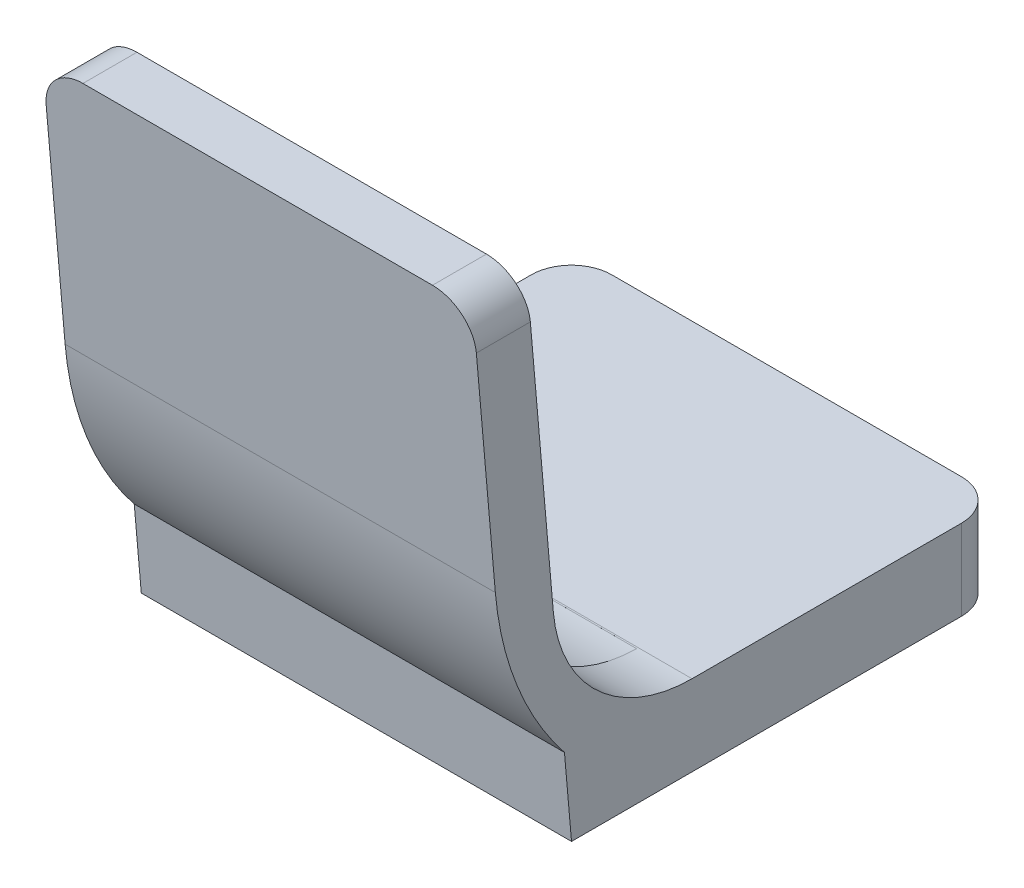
from build123d import *

# Parameters (mm, degrees)
EXTRUSION1_DEPTH        = 8
ESQUISSE2_W             = 14
ESQUISSE2_H             = 14
ESQUISSE2_R             = 3
ENL_V_MAT_EXTRU_3_DEPTH = 2
ESQUISSE3_R             = 2.5
ENL_V_MAT_EXTRU_4_DEPTH = 2
ENL_V_MAT_EXTRU_5_DEPTH = 6
CONG_1_R                = 1.5


with BuildPart() as part:
    # Esquisse1 → Extrusion1 (new, symmetric)
    with BuildSketch(Plane(origin=(0, 0, 0), x_dir=(0, 0, -1), z_dir=(1, 0, 0))):
        with BuildLine():
            Line((16, 0), (4.482546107, 0))
            ThreePointArc((4.482546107, 0), (0.984156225, 1.360449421), (-0.676021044, 4.726955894))
            Line((-0.676021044, 4.726955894), (-1.662284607, 16))
            Line((-1.662284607, 16), (-3.669924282, 16))
            Line((-3.669924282, 16), (-2.832981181, 6.433696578))
            ThreePointArc((-2.832981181, 6.433696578), (-2.022134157, 3.02730258), (-0.262465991, 0))
            Line((-0.262465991, 0), (0, -3))
            Line((0, -3), (16, -3))
            Line((16, -3), (16, 0))
        make_face()
    extrude(amount=EXTRUSION1_DEPTH, both=True)

    # Esquisse2 → Enl_v. mat.-Extru.3 (cut)
    with BuildSketch(Plane.XZ.offset(3)):
        with Locations((0, -8)):
            Rectangle(ESQUISSE2_W, ESQUISSE2_H)
        with Locations(Location((0, -8, 0), (0, 0, 270))):
            Circle(ESQUISSE2_R, mode=Mode.SUBTRACT)
    extrude(amount=-ENL_V_MAT_EXTRU_3_DEPTH, mode=Mode.SUBTRACT)

    # Esquisse3 → Enl_v. mat.-Extru.4 (cut)
    with BuildSketch(Plane.XZ.offset(3)):
        with Locations(Location((0, -8, 0), (0, 0, 270))):
            Circle(ESQUISSE3_R)
    extrude(amount=-ENL_V_MAT_EXTRU_4_DEPTH, mode=Mode.SUBTRACT)

    # Esquisse4 → Enl_v. mat.-Extru.5 (cut, symmetric)
    with BuildSketch(Plane(origin=(0, 0, 0), x_dir=(0, 0, -1), z_dir=(1, 0, 0))):
        with BuildLine():
            Line((-1.662284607, 16), (-1.662284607, 6.082679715))
            ThreePointArc((-1.662284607, 6.082679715), (0.119291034, 1.781575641), (4.420395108, 0))
            Line((4.420395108, 0), (-1.662284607, 16))
        make_face()
    extrude(amount=ENL_V_MAT_EXTRU_5_DEPTH, both=True, mode=Mode.SUBTRACT)

    # Cong_1
    cong_1_edges = [part.edges().sort_by_distance(p)[0] for p in [
        (-8, 16, 2.666104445),
        (-8, -1.5, -16),
        (8, 16, 2.666104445),
        (8, -1.5, -16),
    ]]
    fillet(cong_1_edges, radius=CONG_1_R)


solid = part.part
